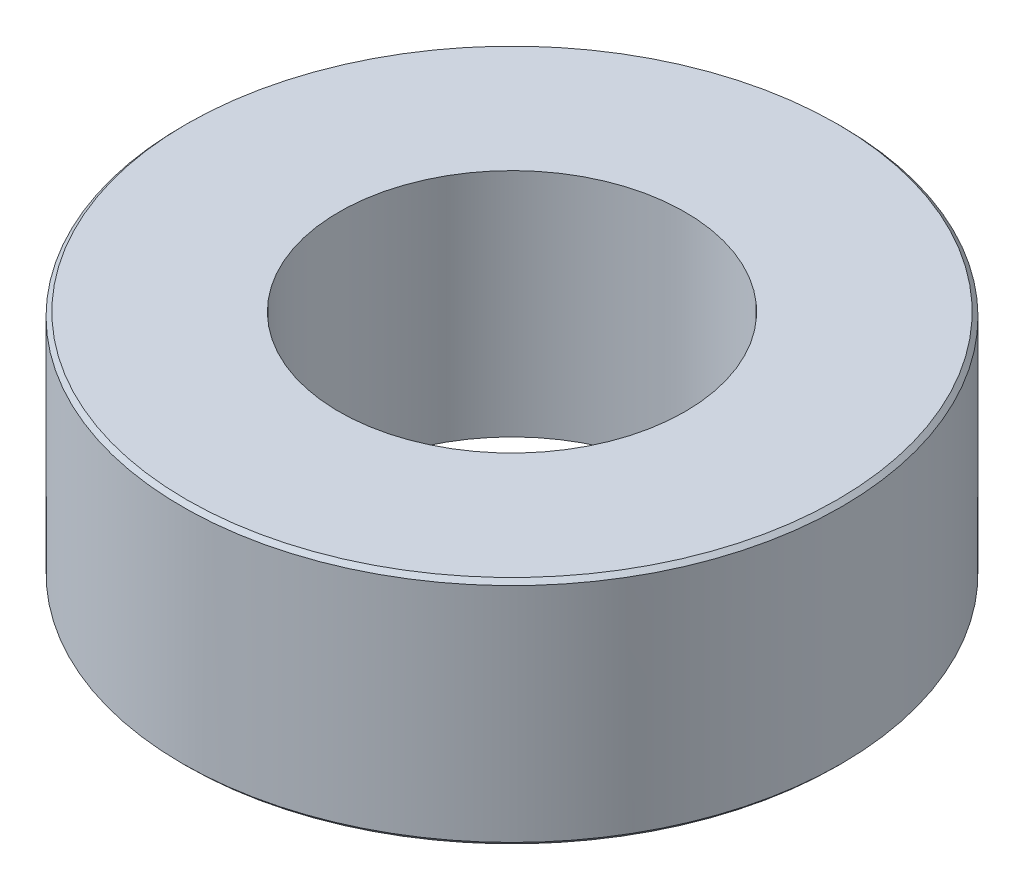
ISO-10303-21;
HEADER;
FILE_DESCRIPTION(('STEP AP214'),'2;1');
FILE_NAME('part.step','',(''),(''),'','','');
FILE_SCHEMA(('AUTOMOTIVE_DESIGN { 1 0 10303 214 1 1 1 1 }'));
ENDSEC;
DATA;
#1=APPLICATION_CONTEXT('core data for automotive mechanical design processes');
#2=APPLICATION_PROTOCOL_DEFINITION('international standard','automotive_design',2000,#1);
#3=PRODUCT_CONTEXT('',#1,'mechanical');
#4=PRODUCT('Part','Part','',(#3));
#5=PRODUCT_RELATED_PRODUCT_CATEGORY('part','',(#4));
#6=PRODUCT_DEFINITION_FORMATION('','',#4);
#7=PRODUCT_DEFINITION_CONTEXT('part definition',#1,'design');
#8=PRODUCT_DEFINITION('design','',#6,#7);
#9=PRODUCT_DEFINITION_SHAPE('','',#8);
#10=(LENGTH_UNIT() NAMED_UNIT(*) SI_UNIT(.MILLI.,.METRE.));
#11=(NAMED_UNIT(*) PLANE_ANGLE_UNIT() SI_UNIT($,.RADIAN.));
#12=(NAMED_UNIT(*) SI_UNIT($,.STERADIAN.) SOLID_ANGLE_UNIT());
#13=UNCERTAINTY_MEASURE_WITH_UNIT(LENGTH_MEASURE(1.E-05),#10,'distance_accuracy_value','');
#14=(GEOMETRIC_REPRESENTATION_CONTEXT(3) GLOBAL_UNCERTAINTY_ASSIGNED_CONTEXT((#13)) GLOBAL_UNIT_ASSIGNED_CONTEXT((#10,
#11,#12)) REPRESENTATION_CONTEXT('',''));
#15=CARTESIAN_POINT('',(0.,0.,0.));
#16=DIRECTION('',(0.,0.,1.));
#17=DIRECTION('',(1.,0.,0.));
#18=AXIS2_PLACEMENT_3D('',#15,#16,#17);
#19=CARTESIAN_POINT('',(0.,0.0499999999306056,0.));
#20=DIRECTION('',(0.,1.,0.));
#21=DIRECTION('',(0.,0.,1.));
#22=AXIS2_PLACEMENT_3D('',#19,#20,#21);
#23=CONICAL_SURFACE('',#22,3.99999999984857,0.785398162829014);
#24=CARTESIAN_POINT('',(0.,5.6843418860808E-11,0.));
#25=DIRECTION('',(0.,1.,0.));
#26=DIRECTION('',(0.,0.,1.));
#27=AXIS2_PLACEMENT_3D('',#24,#25,#26);
#28=CIRCLE('',#27,3.95000000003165);
#29=CARTESIAN_POINT('',(0.,5.6843418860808E-11,3.95000000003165));
#30=VERTEX_POINT('',#29);
#31=EDGE_CURVE('E18',#30,#30,#28,.T.);
#32=ORIENTED_EDGE('',*,*,#31,.T.);
#33=EDGE_LOOP('',(#32));
#34=FACE_BOUND('',#33,.T.);
#35=CARTESIAN_POINT('',(0.,0.0499999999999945,0.));
#36=DIRECTION('',(0.,-1.,0.));
#37=DIRECTION('',(1.,0.,0.));
#38=AXIS2_PLACEMENT_3D('',#35,#36,#37);
#39=CIRCLE('',#38,4.00000000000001);
#40=CARTESIAN_POINT('',(4.00000000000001,0.0499999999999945,0.));
#41=VERTEX_POINT('',#40);
#42=EDGE_CURVE('E30',#41,#41,#39,.F.);
#43=ORIENTED_EDGE('',*,*,#42,.F.);
#44=EDGE_LOOP('',(#43));
#45=FACE_BOUND('',#44,.T.);
#46=ADVANCED_FACE('F15',(#34,#45),#23,.T.);
#47=CARTESIAN_POINT('',(0.,2.80000000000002,0.));
#48=DIRECTION('',(0.,-1.,0.));
#49=DIRECTION('',(1.,0.,0.));
#50=AXIS2_PLACEMENT_3D('',#47,#48,#49);
#51=CYLINDRICAL_SURFACE('',#50,4.00000000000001);
#52=ORIENTED_EDGE('',*,*,#42,.T.);
#53=EDGE_LOOP('',(#52));
#54=FACE_BOUND('',#53,.T.);
#55=CARTESIAN_POINT('',(0.,2.74999999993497,0.));
#56=DIRECTION('',(0.,-1.,0.));
#57=DIRECTION('',(0.,0.,-1.));
#58=AXIS2_PLACEMENT_3D('',#55,#56,#57);
#59=CIRCLE('',#58,3.99999999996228);
#60=CARTESIAN_POINT('',(0.,2.74999999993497,-3.99999999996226));
#61=VERTEX_POINT('',#60);
#62=EDGE_CURVE('E33',#61,#61,#59,.F.);
#63=ORIENTED_EDGE('',*,*,#62,.F.);
#64=EDGE_LOOP('',(#63));
#65=FACE_BOUND('',#64,.T.);
#66=ADVANCED_FACE('F45',(#54,#65),#51,.T.);
#67=CARTESIAN_POINT('',(0.,0.,0.));
#68=DIRECTION('',(0.,1.,0.));
#69=DIRECTION('',(-1.,0.,0.));
#70=AXIS2_PLACEMENT_3D('',#67,#68,#69);
#71=PLANE('',#70);
#72=CARTESIAN_POINT('',(0.,0.,0.));
#73=DIRECTION('',(0.,-1.,0.));
#74=DIRECTION('',(1.,0.,0.));
#75=AXIS2_PLACEMENT_3D('',#72,#73,#74);
#76=CIRCLE('',#75,2.10000000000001);
#77=CARTESIAN_POINT('',(2.10000000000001,0.,0.));
#78=VERTEX_POINT('',#77);
#79=EDGE_CURVE('E27',#78,#78,#76,.F.);
#80=ORIENTED_EDGE('',*,*,#79,.T.);
#81=EDGE_LOOP('',(#80));
#82=FACE_BOUND('',#81,.T.);
#83=ORIENTED_EDGE('',*,*,#31,.F.);
#84=EDGE_LOOP('',(#83));
#85=FACE_BOUND('',#84,.T.);
#86=ADVANCED_FACE('F53',(#82,#85),#71,.F.);
#87=CARTESIAN_POINT('',(0.,2.74999999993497,0.));
#88=DIRECTION('',(0.,-1.,0.));
#89=DIRECTION('',(0.,0.,-1.));
#90=AXIS2_PLACEMENT_3D('',#87,#88,#89);
#91=CONICAL_SURFACE('',#90,3.99999999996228,0.785398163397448);
#92=ORIENTED_EDGE('',*,*,#62,.T.);
#93=EDGE_LOOP('',(#92));
#94=FACE_BOUND('',#93,.T.);
#95=CARTESIAN_POINT('',(0.,2.79999999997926,0.));
#96=DIRECTION('',(0.,-1.,0.));
#97=DIRECTION('',(0.,0.,-1.));
#98=AXIS2_PLACEMENT_3D('',#95,#96,#97);
#99=CIRCLE('',#98,3.94999999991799);
#100=CARTESIAN_POINT('',(0.,2.79999999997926,-3.94999999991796));
#101=VERTEX_POINT('',#100);
#102=EDGE_CURVE('E22',#101,#101,#99,.F.);
#103=ORIENTED_EDGE('',*,*,#102,.F.);
#104=EDGE_LOOP('',(#103));
#105=FACE_BOUND('',#104,.T.);
#106=ADVANCED_FACE('F61',(#94,#105),#91,.T.);
#107=CARTESIAN_POINT('',(0.,2.80000000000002,0.));
#108=DIRECTION('',(0.,-1.,0.));
#109=DIRECTION('',(1.,0.,0.));
#110=AXIS2_PLACEMENT_3D('',#107,#108,#109);
#111=CYLINDRICAL_SURFACE('',#110,2.10000000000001);
#112=CARTESIAN_POINT('',(0.,2.80000000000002,0.));
#113=DIRECTION('',(0.,-1.,0.));
#114=DIRECTION('',(1.,0.,0.));
#115=AXIS2_PLACEMENT_3D('',#112,#113,#114);
#116=CIRCLE('',#115,2.10000000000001);
#117=CARTESIAN_POINT('',(2.10000000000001,2.80000000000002,0.));
#118=VERTEX_POINT('',#117);
#119=EDGE_CURVE('E10',#118,#118,#116,.T.);
#120=ORIENTED_EDGE('',*,*,#119,.F.);
#121=EDGE_LOOP('',(#120));
#122=FACE_BOUND('',#121,.T.);
#123=ORIENTED_EDGE('',*,*,#79,.F.);
#124=EDGE_LOOP('',(#123));
#125=FACE_BOUND('',#124,.T.);
#126=ADVANCED_FACE('F56',(#122,#125),#111,.F.);
#127=CARTESIAN_POINT('',(0.,2.80000000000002,0.));
#128=DIRECTION('',(0.,1.,0.));
#129=DIRECTION('',(-1.,0.,0.));
#130=AXIS2_PLACEMENT_3D('',#127,#128,#129);
#131=PLANE('',#130);
#132=ORIENTED_EDGE('',*,*,#119,.T.);
#133=EDGE_LOOP('',(#132));
#134=FACE_BOUND('',#133,.T.);
#135=ORIENTED_EDGE('',*,*,#102,.T.);
#136=EDGE_LOOP('',(#135));
#137=FACE_BOUND('',#136,.T.);
#138=ADVANCED_FACE('F54',(#134,#137),#131,.T.);
#139=CLOSED_SHELL('',(#46,#66,#86,#106,#126,#138));
#140=MANIFOLD_SOLID_BREP('B1',#139);
#141=ADVANCED_BREP_SHAPE_REPRESENTATION('',(#18,#140),#14);
#142=SHAPE_DEFINITION_REPRESENTATION(#9,#141);
ENDSEC;
END-ISO-10303-21;
